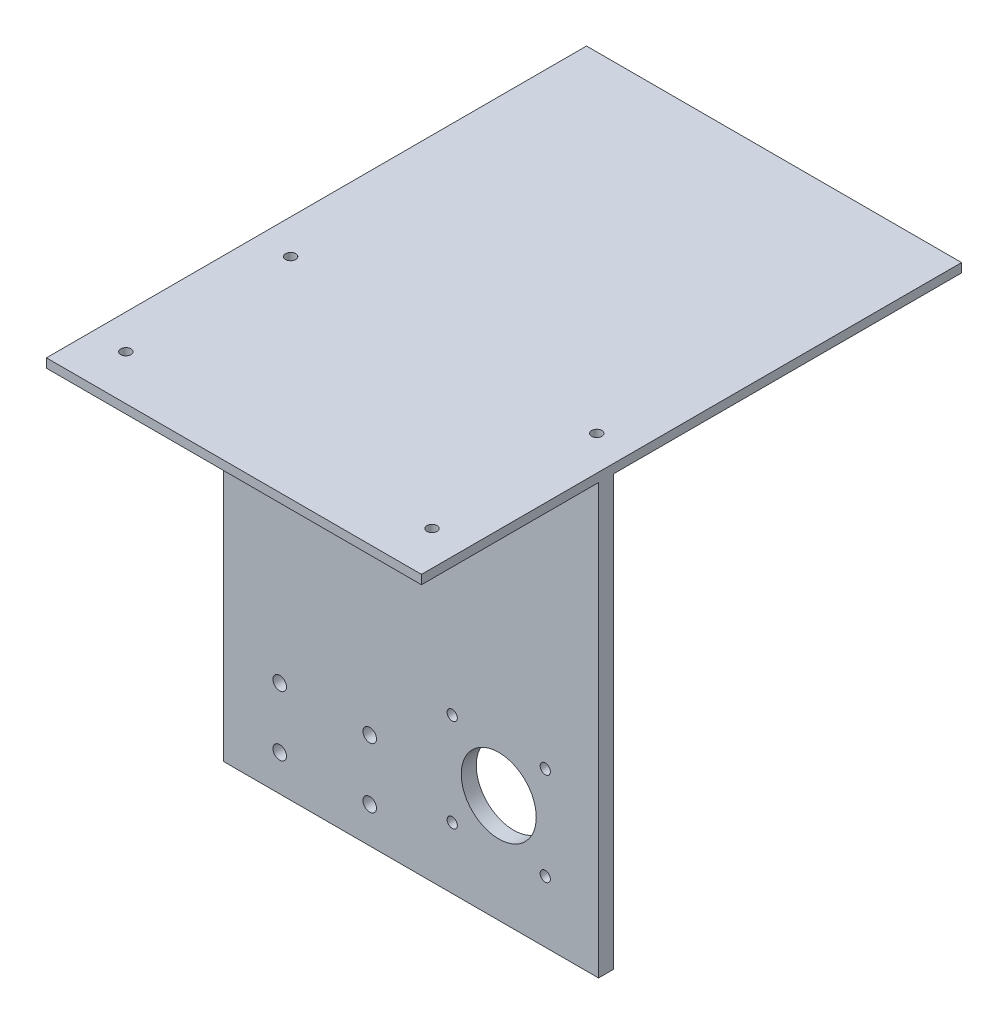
ISO-10303-21;
HEADER;
FILE_DESCRIPTION(('STEP AP214'),'2;1');
FILE_NAME('part.step','',(''),(''),'','','');
FILE_SCHEMA(('AUTOMOTIVE_DESIGN { 1 0 10303 214 1 1 1 1 }'));
ENDSEC;
DATA;
#1=APPLICATION_CONTEXT('core data for automotive mechanical design processes');
#2=APPLICATION_PROTOCOL_DEFINITION('international standard','automotive_design',2000,#1);
#3=PRODUCT_CONTEXT('',#1,'mechanical');
#4=PRODUCT('Part','Part','',(#3));
#5=PRODUCT_RELATED_PRODUCT_CATEGORY('part','',(#4));
#6=PRODUCT_DEFINITION_FORMATION('','',#4);
#7=PRODUCT_DEFINITION_CONTEXT('part definition',#1,'design');
#8=PRODUCT_DEFINITION('design','',#6,#7);
#9=PRODUCT_DEFINITION_SHAPE('','',#8);
#10=(LENGTH_UNIT() NAMED_UNIT(*) SI_UNIT(.MILLI.,.METRE.));
#11=(NAMED_UNIT(*) PLANE_ANGLE_UNIT() SI_UNIT($,.RADIAN.));
#12=(NAMED_UNIT(*) SI_UNIT($,.STERADIAN.) SOLID_ANGLE_UNIT());
#13=UNCERTAINTY_MEASURE_WITH_UNIT(LENGTH_MEASURE(1.E-05),#10,'distance_accuracy_value','');
#14=(GEOMETRIC_REPRESENTATION_CONTEXT(3) GLOBAL_UNCERTAINTY_ASSIGNED_CONTEXT((#13)) GLOBAL_UNIT_ASSIGNED_CONTEXT((#10,
#11,#12)) REPRESENTATION_CONTEXT('',''));
#15=CARTESIAN_POINT('',(0.,0.,0.));
#16=DIRECTION('',(0.,0.,1.));
#17=DIRECTION('',(1.,0.,0.));
#18=AXIS2_PLACEMENT_3D('',#15,#16,#17);
#19=CARTESIAN_POINT('',(62.5,70.,5.));
#20=DIRECTION('',(-1.,0.,0.));
#21=DIRECTION('',(0.,-1.,0.));
#22=AXIS2_PLACEMENT_3D('',#19,#20,#21);
#23=PLANE('',#22);
#24=DIRECTION('',(0.,1.,0.));
#25=VECTOR('',#24,1.);
#26=CARTESIAN_POINT('',(62.5,70.,0.));
#27=LINE('',#26,#25);
#28=CARTESIAN_POINT('',(62.5,-70.,0.));
#29=VERTEX_POINT('',#28);
#30=CARTESIAN_POINT('',(62.5,73.,0.));
#31=VERTEX_POINT('',#30);
#32=EDGE_CURVE('E74',#29,#31,#27,.T.);
#33=ORIENTED_EDGE('',*,*,#32,.T.);
#34=DIRECTION('',(0.,0.,-1.));
#35=VECTOR('',#34,1.);
#36=CARTESIAN_POINT('',(62.5,73.,-116.));
#37=LINE('',#36,#35);
#38=CARTESIAN_POINT('',(62.5,73.,-116.));
#39=VERTEX_POINT('',#38);
#40=EDGE_CURVE('E280',#31,#39,#37,.T.);
#41=ORIENTED_EDGE('',*,*,#40,.T.);
#42=DIRECTION('',(0.,-1.,0.));
#43=VECTOR('',#42,1.);
#44=CARTESIAN_POINT('',(62.5,76.,-116.));
#45=LINE('',#44,#43);
#46=CARTESIAN_POINT('',(62.5,76.,-116.));
#47=VERTEX_POINT('',#46);
#48=EDGE_CURVE('E143',#47,#39,#45,.T.);
#49=ORIENTED_EDGE('',*,*,#48,.F.);
#50=DIRECTION('',(0.,0.,-1.));
#51=VECTOR('',#50,1.);
#52=CARTESIAN_POINT('',(62.5,76.,-116.));
#53=LINE('',#52,#51);
#54=CARTESIAN_POINT('',(62.5,76.,64.));
#55=VERTEX_POINT('',#54);
#56=EDGE_CURVE('E118',#55,#47,#53,.T.);
#57=ORIENTED_EDGE('',*,*,#56,.F.);
#58=DIRECTION('',(0.,-1.,0.));
#59=VECTOR('',#58,1.);
#60=CARTESIAN_POINT('',(62.5,76.,64.));
#61=LINE('',#60,#59);
#62=CARTESIAN_POINT('',(62.5,73.,64.));
#63=VERTEX_POINT('',#62);
#64=EDGE_CURVE('E114',#55,#63,#61,.T.);
#65=ORIENTED_EDGE('',*,*,#64,.T.);
#66=CARTESIAN_POINT('',(62.5,73.,5.));
#67=VERTEX_POINT('',#66);
#68=EDGE_CURVE('E285',#63,#67,#37,.T.);
#69=ORIENTED_EDGE('',*,*,#68,.T.);
#70=DIRECTION('',(0.,1.,0.));
#71=VECTOR('',#70,1.);
#72=CARTESIAN_POINT('',(62.5,70.,5.));
#73=LINE('',#72,#71);
#74=CARTESIAN_POINT('',(62.5,-70.,5.));
#75=VERTEX_POINT('',#74);
#76=EDGE_CURVE('E254',#75,#67,#73,.T.);
#77=ORIENTED_EDGE('',*,*,#76,.F.);
#78=DIRECTION('',(0.,0.,-1.));
#79=VECTOR('',#78,1.);
#80=CARTESIAN_POINT('',(62.5,-70.,5.));
#81=LINE('',#80,#79);
#82=EDGE_CURVE('E47',#75,#29,#81,.T.);
#83=ORIENTED_EDGE('',*,*,#82,.T.);
#84=EDGE_LOOP('',(#33,#41,#49,#57,#65,#69,#77,#83));
#85=FACE_BOUND('',#84,.T.);
#86=ADVANCED_FACE('F38',(#85),#23,.F.);
#87=CARTESIAN_POINT('',(-62.5,70.,5.));
#88=DIRECTION('',(1.,0.,0.));
#89=DIRECTION('',(0.,1.,0.));
#90=AXIS2_PLACEMENT_3D('',#87,#88,#89);
#91=PLANE('',#90);
#92=DIRECTION('',(0.,-1.,0.));
#93=VECTOR('',#92,1.);
#94=CARTESIAN_POINT('',(-62.5,70.,0.));
#95=LINE('',#94,#93);
#96=CARTESIAN_POINT('',(-62.5,73.,0.));
#97=VERTEX_POINT('',#96);
#98=CARTESIAN_POINT('',(-62.5,-70.,0.));
#99=VERTEX_POINT('',#98);
#100=EDGE_CURVE('E66',#97,#99,#95,.T.);
#101=ORIENTED_EDGE('',*,*,#100,.T.);
#102=DIRECTION('',(0.,0.,-1.));
#103=VECTOR('',#102,1.);
#104=CARTESIAN_POINT('',(-62.5,-70.,5.));
#105=LINE('',#104,#103);
#106=CARTESIAN_POINT('',(-62.5,-70.,5.));
#107=VERTEX_POINT('',#106);
#108=EDGE_CURVE('E11',#107,#99,#105,.T.);
#109=ORIENTED_EDGE('',*,*,#108,.F.);
#110=DIRECTION('',(0.,-1.,0.));
#111=VECTOR('',#110,1.);
#112=CARTESIAN_POINT('',(-62.5,70.,5.));
#113=LINE('',#112,#111);
#114=CARTESIAN_POINT('',(-62.5,73.,5.));
#115=VERTEX_POINT('',#114);
#116=EDGE_CURVE('E257',#115,#107,#113,.T.);
#117=ORIENTED_EDGE('',*,*,#116,.F.);
#118=DIRECTION('',(0.,0.,1.));
#119=VECTOR('',#118,1.);
#120=CARTESIAN_POINT('',(-62.5,73.,-116.));
#121=LINE('',#120,#119);
#122=CARTESIAN_POINT('',(-62.5,73.,64.));
#123=VERTEX_POINT('',#122);
#124=EDGE_CURVE('E132',#115,#123,#121,.T.);
#125=ORIENTED_EDGE('',*,*,#124,.T.);
#126=DIRECTION('',(0.,-1.,0.));
#127=VECTOR('',#126,1.);
#128=CARTESIAN_POINT('',(-62.5,76.,64.));
#129=LINE('',#128,#127);
#130=CARTESIAN_POINT('',(-62.5,76.,64.));
#131=VERTEX_POINT('',#130);
#132=EDGE_CURVE('E112',#131,#123,#129,.T.);
#133=ORIENTED_EDGE('',*,*,#132,.F.);
#134=DIRECTION('',(0.,0.,1.));
#135=VECTOR('',#134,1.);
#136=CARTESIAN_POINT('',(-62.5,76.,-116.));
#137=LINE('',#136,#135);
#138=CARTESIAN_POINT('',(-62.5,76.,-116.));
#139=VERTEX_POINT('',#138);
#140=EDGE_CURVE('E119',#139,#131,#137,.T.);
#141=ORIENTED_EDGE('',*,*,#140,.F.);
#142=DIRECTION('',(0.,-1.,0.));
#143=VECTOR('',#142,1.);
#144=CARTESIAN_POINT('',(-62.5,76.,-116.));
#145=LINE('',#144,#143);
#146=CARTESIAN_POINT('',(-62.5,73.,-116.));
#147=VERTEX_POINT('',#146);
#148=EDGE_CURVE('E297',#139,#147,#145,.T.);
#149=ORIENTED_EDGE('',*,*,#148,.T.);
#150=EDGE_CURVE('E291',#147,#97,#121,.T.);
#151=ORIENTED_EDGE('',*,*,#150,.T.);
#152=EDGE_LOOP('',(#101,#109,#117,#125,#133,#141,#149,#151));
#153=FACE_BOUND('',#152,.T.);
#154=ADVANCED_FACE('F130',(#153),#91,.F.);
#155=CARTESIAN_POINT('',(-62.5,-70.,5.));
#156=DIRECTION('',(0.,1.,0.));
#157=DIRECTION('',(0.,0.,1.));
#158=AXIS2_PLACEMENT_3D('',#155,#156,#157);
#159=PLANE('',#158);
#160=DIRECTION('',(1.,0.,0.));
#161=VECTOR('',#160,1.);
#162=CARTESIAN_POINT('',(-62.5,-70.,0.));
#163=LINE('',#162,#161);
#164=EDGE_CURVE('E258',#99,#29,#163,.T.);
#165=ORIENTED_EDGE('',*,*,#164,.T.);
#166=ORIENTED_EDGE('',*,*,#82,.F.);
#167=DIRECTION('',(1.,0.,0.));
#168=VECTOR('',#167,1.);
#169=CARTESIAN_POINT('',(-62.5,-70.,5.));
#170=LINE('',#169,#168);
#171=EDGE_CURVE('E55',#107,#75,#170,.T.);
#172=ORIENTED_EDGE('',*,*,#171,.F.);
#173=ORIENTED_EDGE('',*,*,#108,.T.);
#174=EDGE_LOOP('',(#165,#166,#172,#173));
#175=FACE_BOUND('',#174,.T.);
#176=ADVANCED_FACE('F378',(#175),#159,.F.);
#177=CARTESIAN_POINT('',(0.,0.,5.));
#178=DIRECTION('',(0.,0.,1.));
#179=DIRECTION('',(1.,0.,0.));
#180=AXIS2_PLACEMENT_3D('',#177,#178,#179);
#181=PLANE('',#180);
#182=CARTESIAN_POINT('',(29.25,-34.,5.));
#183=DIRECTION('',(0.,0.,1.));
#184=DIRECTION('',(1.,0.,0.));
#185=AXIS2_PLACEMENT_3D('',#182,#183,#184);
#186=CIRCLE('',#185,12.5);
#187=CARTESIAN_POINT('',(41.75,-34.,5.));
#188=VERTEX_POINT('',#187);
#189=EDGE_CURVE('E150',#188,#188,#186,.T.);
#190=ORIENTED_EDGE('',*,*,#189,.F.);
#191=EDGE_LOOP('',(#190));
#192=FACE_BOUND('',#191,.T.);
#193=CARTESIAN_POINT('',(-12.75,41.,5.));
#194=DIRECTION('',(0.,0.,1.));
#195=DIRECTION('',(1.,0.,0.));
#196=AXIS2_PLACEMENT_3D('',#193,#194,#195);
#197=CIRCLE('',#196,11.);
#198=CARTESIAN_POINT('',(-1.75,41.,5.));
#199=VERTEX_POINT('',#198);
#200=EDGE_CURVE('E155',#199,#199,#197,.T.);
#201=ORIENTED_EDGE('',*,*,#200,.F.);
#202=EDGE_LOOP('',(#201));
#203=FACE_BOUND('',#202,.T.);
#204=CARTESIAN_POINT('',(13.75,-18.5,5.));
#205=DIRECTION('',(0.,0.,1.));
#206=DIRECTION('',(1.,0.,0.));
#207=AXIS2_PLACEMENT_3D('',#204,#205,#206);
#208=CIRCLE('',#207,1.7);
#209=CARTESIAN_POINT('',(15.45,-18.5,5.));
#210=VERTEX_POINT('',#209);
#211=EDGE_CURVE('E163',#210,#210,#208,.T.);
#212=ORIENTED_EDGE('',*,*,#211,.F.);
#213=EDGE_LOOP('',(#212));
#214=FACE_BOUND('',#213,.T.);
#215=CARTESIAN_POINT('',(44.75,-18.5,5.));
#216=DIRECTION('',(0.,0.,1.));
#217=DIRECTION('',(1.,0.,0.));
#218=AXIS2_PLACEMENT_3D('',#215,#216,#217);
#219=CIRCLE('',#218,1.7);
#220=CARTESIAN_POINT('',(46.45,-18.5,5.));
#221=VERTEX_POINT('',#220);
#222=EDGE_CURVE('E174',#221,#221,#219,.T.);
#223=ORIENTED_EDGE('',*,*,#222,.F.);
#224=EDGE_LOOP('',(#223));
#225=FACE_BOUND('',#224,.T.);
#226=CARTESIAN_POINT('',(13.75,-49.5,5.));
#227=DIRECTION('',(0.,0.,1.));
#228=DIRECTION('',(1.,0.,0.));
#229=AXIS2_PLACEMENT_3D('',#226,#227,#228);
#230=CIRCLE('',#229,1.7);
#231=CARTESIAN_POINT('',(15.45,-49.5,5.));
#232=VERTEX_POINT('',#231);
#233=EDGE_CURVE('E182',#232,#232,#230,.T.);
#234=ORIENTED_EDGE('',*,*,#233,.F.);
#235=EDGE_LOOP('',(#234));
#236=FACE_BOUND('',#235,.T.);
#237=CARTESIAN_POINT('',(44.75,-49.5,5.));
#238=DIRECTION('',(0.,0.,1.));
#239=DIRECTION('',(1.,0.,0.));
#240=AXIS2_PLACEMENT_3D('',#237,#238,#239);
#241=CIRCLE('',#240,1.7);
#242=CARTESIAN_POINT('',(46.45,-49.5,5.));
#243=VERTEX_POINT('',#242);
#244=EDGE_CURVE('E190',#243,#243,#241,.T.);
#245=ORIENTED_EDGE('',*,*,#244,.F.);
#246=EDGE_LOOP('',(#245));
#247=FACE_BOUND('',#246,.T.);
#248=CARTESIAN_POINT('',(-20.25,53.9903810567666,5.));
#249=DIRECTION('',(0.,0.,1.));
#250=DIRECTION('',(1.,0.,0.));
#251=AXIS2_PLACEMENT_3D('',#248,#249,#250);
#252=CIRCLE('',#251,1.7);
#253=CARTESIAN_POINT('',(-18.55,53.9903810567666,5.));
#254=VERTEX_POINT('',#253);
#255=EDGE_CURVE('E198',#254,#254,#252,.T.);
#256=ORIENTED_EDGE('',*,*,#255,.F.);
#257=EDGE_LOOP('',(#256));
#258=FACE_BOUND('',#257,.T.);
#259=CARTESIAN_POINT('',(2.25,41.,5.));
#260=DIRECTION('',(0.,0.,1.));
#261=DIRECTION('',(1.,0.,0.));
#262=AXIS2_PLACEMENT_3D('',#259,#260,#261);
#263=CIRCLE('',#262,1.7);
#264=CARTESIAN_POINT('',(3.95,41.,5.));
#265=VERTEX_POINT('',#264);
#266=EDGE_CURVE('E206',#265,#265,#263,.T.);
#267=ORIENTED_EDGE('',*,*,#266,.F.);
#268=EDGE_LOOP('',(#267));
#269=FACE_BOUND('',#268,.T.);
#270=CARTESIAN_POINT('',(-20.25,28.0096189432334,5.));
#271=DIRECTION('',(0.,0.,1.));
#272=DIRECTION('',(1.,0.,0.));
#273=AXIS2_PLACEMENT_3D('',#270,#271,#272);
#274=CIRCLE('',#273,1.7);
#275=CARTESIAN_POINT('',(-18.55,28.0096189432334,5.));
#276=VERTEX_POINT('',#275);
#277=EDGE_CURVE('E214',#276,#276,#274,.T.);
#278=ORIENTED_EDGE('',*,*,#277,.F.);
#279=EDGE_LOOP('',(#278));
#280=FACE_BOUND('',#279,.T.);
#281=CARTESIAN_POINT('',(-43.75,-38.,5.));
#282=DIRECTION('',(0.,0.,1.));
#283=DIRECTION('',(1.,0.,0.));
#284=AXIS2_PLACEMENT_3D('',#281,#282,#283);
#285=CIRCLE('',#284,2.25);
#286=CARTESIAN_POINT('',(-41.5,-38.,5.));
#287=VERTEX_POINT('',#286);
#288=EDGE_CURVE('E222',#287,#287,#285,.T.);
#289=ORIENTED_EDGE('',*,*,#288,.F.);
#290=EDGE_LOOP('',(#289));
#291=FACE_BOUND('',#290,.T.);
#292=CARTESIAN_POINT('',(-13.75,-38.,5.));
#293=DIRECTION('',(0.,0.,1.));
#294=DIRECTION('',(1.,0.,0.));
#295=AXIS2_PLACEMENT_3D('',#292,#293,#294);
#296=CIRCLE('',#295,2.25);
#297=CARTESIAN_POINT('',(-11.5,-38.,5.));
#298=VERTEX_POINT('',#297);
#299=EDGE_CURVE('E230',#298,#298,#296,.T.);
#300=ORIENTED_EDGE('',*,*,#299,.F.);
#301=EDGE_LOOP('',(#300));
#302=FACE_BOUND('',#301,.T.);
#303=CARTESIAN_POINT('',(-43.75,-58.,5.));
#304=DIRECTION('',(0.,0.,1.));
#305=DIRECTION('',(1.,0.,0.));
#306=AXIS2_PLACEMENT_3D('',#303,#304,#305);
#307=CIRCLE('',#306,2.25);
#308=CARTESIAN_POINT('',(-41.5,-58.,5.));
#309=VERTEX_POINT('',#308);
#310=EDGE_CURVE('E238',#309,#309,#307,.T.);
#311=ORIENTED_EDGE('',*,*,#310,.F.);
#312=EDGE_LOOP('',(#311));
#313=FACE_BOUND('',#312,.T.);
#314=CARTESIAN_POINT('',(-13.75,-58.,5.));
#315=DIRECTION('',(0.,0.,1.));
#316=DIRECTION('',(1.,0.,0.));
#317=AXIS2_PLACEMENT_3D('',#314,#315,#316);
#318=CIRCLE('',#317,2.25);
#319=CARTESIAN_POINT('',(-11.5,-58.,5.));
#320=VERTEX_POINT('',#319);
#321=EDGE_CURVE('E246',#320,#320,#318,.T.);
#322=ORIENTED_EDGE('',*,*,#321,.F.);
#323=EDGE_LOOP('',(#322));
#324=FACE_BOUND('',#323,.T.);
#325=ORIENTED_EDGE('',*,*,#76,.T.);
#326=DIRECTION('',(1.,0.,0.));
#327=VECTOR('',#326,1.);
#328=CARTESIAN_POINT('',(-62.5,73.,5.));
#329=LINE('',#328,#327);
#330=EDGE_CURVE('E135',#115,#67,#329,.T.);
#331=ORIENTED_EDGE('',*,*,#330,.F.);
#332=ORIENTED_EDGE('',*,*,#116,.T.);
#333=ORIENTED_EDGE('',*,*,#171,.T.);
#334=EDGE_LOOP('',(#325,#331,#332,#333));
#335=FACE_BOUND('',#334,.T.);
#336=ADVANCED_FACE('F382',(#192,#203,#214,#225,#236,#247,#258,#269,#280,#291,#302,#313,#324,
#335),#181,.T.);
#337=CARTESIAN_POINT('',(0.,0.,0.));
#338=DIRECTION('',(0.,0.,1.));
#339=DIRECTION('',(1.,0.,0.));
#340=AXIS2_PLACEMENT_3D('',#337,#338,#339);
#341=PLANE('',#340);
#342=CARTESIAN_POINT('',(29.25,-34.,0.));
#343=DIRECTION('',(0.,0.,1.));
#344=DIRECTION('',(1.,0.,0.));
#345=AXIS2_PLACEMENT_3D('',#342,#343,#344);
#346=CIRCLE('',#345,12.5);
#347=CARTESIAN_POINT('',(41.75,-34.,0.));
#348=VERTEX_POINT('',#347);
#349=EDGE_CURVE('E151',#348,#348,#346,.T.);
#350=ORIENTED_EDGE('',*,*,#349,.T.);
#351=EDGE_LOOP('',(#350));
#352=FACE_BOUND('',#351,.T.);
#353=CARTESIAN_POINT('',(-12.75,41.,0.));
#354=DIRECTION('',(0.,0.,1.));
#355=DIRECTION('',(1.,0.,0.));
#356=AXIS2_PLACEMENT_3D('',#353,#354,#355);
#357=CIRCLE('',#356,11.);
#358=CARTESIAN_POINT('',(-1.75,41.,0.));
#359=VERTEX_POINT('',#358);
#360=EDGE_CURVE('E159',#359,#359,#357,.T.);
#361=ORIENTED_EDGE('',*,*,#360,.T.);
#362=EDGE_LOOP('',(#361));
#363=FACE_BOUND('',#362,.T.);
#364=CARTESIAN_POINT('',(13.75,-18.5,0.));
#365=DIRECTION('',(0.,0.,1.));
#366=DIRECTION('',(1.,0.,0.));
#367=AXIS2_PLACEMENT_3D('',#364,#365,#366);
#368=CIRCLE('',#367,1.7);
#369=CARTESIAN_POINT('',(15.45,-18.5,0.));
#370=VERTEX_POINT('',#369);
#371=EDGE_CURVE('E170',#370,#370,#368,.T.);
#372=ORIENTED_EDGE('',*,*,#371,.T.);
#373=EDGE_LOOP('',(#372));
#374=FACE_BOUND('',#373,.T.);
#375=CARTESIAN_POINT('',(44.75,-18.5,0.));
#376=DIRECTION('',(0.,0.,1.));
#377=DIRECTION('',(1.,0.,0.));
#378=AXIS2_PLACEMENT_3D('',#375,#376,#377);
#379=CIRCLE('',#378,1.7);
#380=CARTESIAN_POINT('',(46.45,-18.5,0.));
#381=VERTEX_POINT('',#380);
#382=EDGE_CURVE('E178',#381,#381,#379,.T.);
#383=ORIENTED_EDGE('',*,*,#382,.T.);
#384=EDGE_LOOP('',(#383));
#385=FACE_BOUND('',#384,.T.);
#386=CARTESIAN_POINT('',(13.75,-49.5,0.));
#387=DIRECTION('',(0.,0.,1.));
#388=DIRECTION('',(1.,0.,0.));
#389=AXIS2_PLACEMENT_3D('',#386,#387,#388);
#390=CIRCLE('',#389,1.7);
#391=CARTESIAN_POINT('',(15.45,-49.5,0.));
#392=VERTEX_POINT('',#391);
#393=EDGE_CURVE('E186',#392,#392,#390,.T.);
#394=ORIENTED_EDGE('',*,*,#393,.T.);
#395=EDGE_LOOP('',(#394));
#396=FACE_BOUND('',#395,.T.);
#397=CARTESIAN_POINT('',(44.75,-49.5,0.));
#398=DIRECTION('',(0.,0.,1.));
#399=DIRECTION('',(1.,0.,0.));
#400=AXIS2_PLACEMENT_3D('',#397,#398,#399);
#401=CIRCLE('',#400,1.7);
#402=CARTESIAN_POINT('',(46.45,-49.5,0.));
#403=VERTEX_POINT('',#402);
#404=EDGE_CURVE('E194',#403,#403,#401,.T.);
#405=ORIENTED_EDGE('',*,*,#404,.T.);
#406=EDGE_LOOP('',(#405));
#407=FACE_BOUND('',#406,.T.);
#408=CARTESIAN_POINT('',(-20.25,53.9903810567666,0.));
#409=DIRECTION('',(0.,0.,1.));
#410=DIRECTION('',(1.,0.,0.));
#411=AXIS2_PLACEMENT_3D('',#408,#409,#410);
#412=CIRCLE('',#411,1.7);
#413=CARTESIAN_POINT('',(-18.55,53.9903810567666,0.));
#414=VERTEX_POINT('',#413);
#415=EDGE_CURVE('E202',#414,#414,#412,.T.);
#416=ORIENTED_EDGE('',*,*,#415,.T.);
#417=EDGE_LOOP('',(#416));
#418=FACE_BOUND('',#417,.T.);
#419=CARTESIAN_POINT('',(2.25,41.,0.));
#420=DIRECTION('',(0.,0.,1.));
#421=DIRECTION('',(1.,0.,0.));
#422=AXIS2_PLACEMENT_3D('',#419,#420,#421);
#423=CIRCLE('',#422,1.7);
#424=CARTESIAN_POINT('',(3.95,41.,0.));
#425=VERTEX_POINT('',#424);
#426=EDGE_CURVE('E210',#425,#425,#423,.T.);
#427=ORIENTED_EDGE('',*,*,#426,.T.);
#428=EDGE_LOOP('',(#427));
#429=FACE_BOUND('',#428,.T.);
#430=CARTESIAN_POINT('',(-20.25,28.0096189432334,0.));
#431=DIRECTION('',(0.,0.,1.));
#432=DIRECTION('',(1.,0.,0.));
#433=AXIS2_PLACEMENT_3D('',#430,#431,#432);
#434=CIRCLE('',#433,1.7);
#435=CARTESIAN_POINT('',(-18.55,28.0096189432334,0.));
#436=VERTEX_POINT('',#435);
#437=EDGE_CURVE('E218',#436,#436,#434,.T.);
#438=ORIENTED_EDGE('',*,*,#437,.T.);
#439=EDGE_LOOP('',(#438));
#440=FACE_BOUND('',#439,.T.);
#441=CARTESIAN_POINT('',(-43.75,-38.,0.));
#442=DIRECTION('',(0.,0.,1.));
#443=DIRECTION('',(1.,0.,0.));
#444=AXIS2_PLACEMENT_3D('',#441,#442,#443);
#445=CIRCLE('',#444,2.25);
#446=CARTESIAN_POINT('',(-41.5,-38.,0.));
#447=VERTEX_POINT('',#446);
#448=EDGE_CURVE('E226',#447,#447,#445,.T.);
#449=ORIENTED_EDGE('',*,*,#448,.T.);
#450=EDGE_LOOP('',(#449));
#451=FACE_BOUND('',#450,.T.);
#452=CARTESIAN_POINT('',(-13.75,-38.,0.));
#453=DIRECTION('',(0.,0.,1.));
#454=DIRECTION('',(1.,0.,0.));
#455=AXIS2_PLACEMENT_3D('',#452,#453,#454);
#456=CIRCLE('',#455,2.25);
#457=CARTESIAN_POINT('',(-11.5,-38.,0.));
#458=VERTEX_POINT('',#457);
#459=EDGE_CURVE('E234',#458,#458,#456,.T.);
#460=ORIENTED_EDGE('',*,*,#459,.T.);
#461=EDGE_LOOP('',(#460));
#462=FACE_BOUND('',#461,.T.);
#463=CARTESIAN_POINT('',(-43.75,-58.,0.));
#464=DIRECTION('',(0.,0.,1.));
#465=DIRECTION('',(1.,0.,0.));
#466=AXIS2_PLACEMENT_3D('',#463,#464,#465);
#467=CIRCLE('',#466,2.25);
#468=CARTESIAN_POINT('',(-41.5,-58.,0.));
#469=VERTEX_POINT('',#468);
#470=EDGE_CURVE('E242',#469,#469,#467,.T.);
#471=ORIENTED_EDGE('',*,*,#470,.T.);
#472=EDGE_LOOP('',(#471));
#473=FACE_BOUND('',#472,.T.);
#474=CARTESIAN_POINT('',(-13.75,-58.,0.));
#475=DIRECTION('',(0.,0.,1.));
#476=DIRECTION('',(1.,0.,0.));
#477=AXIS2_PLACEMENT_3D('',#474,#475,#476);
#478=CIRCLE('',#477,2.25);
#479=CARTESIAN_POINT('',(-11.5,-58.,0.));
#480=VERTEX_POINT('',#479);
#481=EDGE_CURVE('E250',#480,#480,#478,.T.);
#482=ORIENTED_EDGE('',*,*,#481,.T.);
#483=EDGE_LOOP('',(#482));
#484=FACE_BOUND('',#483,.T.);
#485=ORIENTED_EDGE('',*,*,#32,.F.);
#486=ORIENTED_EDGE('',*,*,#164,.F.);
#487=ORIENTED_EDGE('',*,*,#100,.F.);
#488=DIRECTION('',(-1.,0.,0.));
#489=VECTOR('',#488,1.);
#490=CARTESIAN_POINT('',(-62.5,73.,0.));
#491=LINE('',#490,#489);
#492=EDGE_CURVE('E141',#31,#97,#491,.T.);
#493=ORIENTED_EDGE('',*,*,#492,.F.);
#494=EDGE_LOOP('',(#485,#486,#487,#493));
#495=FACE_BOUND('',#494,.T.);
#496=ADVANCED_FACE('F275',(#352,#363,#374,#385,#396,#407,#418,#429,#440,#451,#462,#473,#484,
#495),#341,.F.);
#497=CARTESIAN_POINT('',(-13.75,-58.,5.));
#498=DIRECTION('',(0.,0.,1.));
#499=DIRECTION('',(1.,0.,0.));
#500=AXIS2_PLACEMENT_3D('',#497,#498,#499);
#501=CYLINDRICAL_SURFACE('',#500,2.25);
#502=ORIENTED_EDGE('',*,*,#481,.F.);
#503=EDGE_LOOP('',(#502));
#504=FACE_BOUND('',#503,.T.);
#505=ORIENTED_EDGE('',*,*,#321,.T.);
#506=EDGE_LOOP('',(#505));
#507=FACE_BOUND('',#506,.T.);
#508=ADVANCED_FACE('F387',(#504,#507),#501,.F.);
#509=CARTESIAN_POINT('',(-43.75,-58.,5.));
#510=DIRECTION('',(0.,0.,1.));
#511=DIRECTION('',(1.,0.,0.));
#512=AXIS2_PLACEMENT_3D('',#509,#510,#511);
#513=CYLINDRICAL_SURFACE('',#512,2.25);
#514=ORIENTED_EDGE('',*,*,#470,.F.);
#515=EDGE_LOOP('',(#514));
#516=FACE_BOUND('',#515,.T.);
#517=ORIENTED_EDGE('',*,*,#310,.T.);
#518=EDGE_LOOP('',(#517));
#519=FACE_BOUND('',#518,.T.);
#520=ADVANCED_FACE('F393',(#516,#519),#513,.F.);
#521=CARTESIAN_POINT('',(-13.75,-38.,5.));
#522=DIRECTION('',(0.,0.,1.));
#523=DIRECTION('',(1.,0.,0.));
#524=AXIS2_PLACEMENT_3D('',#521,#522,#523);
#525=CYLINDRICAL_SURFACE('',#524,2.25);
#526=ORIENTED_EDGE('',*,*,#459,.F.);
#527=EDGE_LOOP('',(#526));
#528=FACE_BOUND('',#527,.T.);
#529=ORIENTED_EDGE('',*,*,#299,.T.);
#530=EDGE_LOOP('',(#529));
#531=FACE_BOUND('',#530,.T.);
#532=ADVANCED_FACE('F397',(#528,#531),#525,.F.);
#533=CARTESIAN_POINT('',(-43.75,-38.,5.));
#534=DIRECTION('',(0.,0.,1.));
#535=DIRECTION('',(1.,0.,0.));
#536=AXIS2_PLACEMENT_3D('',#533,#534,#535);
#537=CYLINDRICAL_SURFACE('',#536,2.25);
#538=ORIENTED_EDGE('',*,*,#448,.F.);
#539=EDGE_LOOP('',(#538));
#540=FACE_BOUND('',#539,.T.);
#541=ORIENTED_EDGE('',*,*,#288,.T.);
#542=EDGE_LOOP('',(#541));
#543=FACE_BOUND('',#542,.T.);
#544=ADVANCED_FACE('F401',(#540,#543),#537,.F.);
#545=CARTESIAN_POINT('',(-20.25,28.0096189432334,5.));
#546=DIRECTION('',(0.,0.,1.));
#547=DIRECTION('',(1.,0.,0.));
#548=AXIS2_PLACEMENT_3D('',#545,#546,#547);
#549=CYLINDRICAL_SURFACE('',#548,1.7);
#550=ORIENTED_EDGE('',*,*,#437,.F.);
#551=EDGE_LOOP('',(#550));
#552=FACE_BOUND('',#551,.T.);
#553=ORIENTED_EDGE('',*,*,#277,.T.);
#554=EDGE_LOOP('',(#553));
#555=FACE_BOUND('',#554,.T.);
#556=ADVANCED_FACE('F405',(#552,#555),#549,.F.);
#557=CARTESIAN_POINT('',(2.25,41.,5.));
#558=DIRECTION('',(0.,0.,1.));
#559=DIRECTION('',(1.,0.,0.));
#560=AXIS2_PLACEMENT_3D('',#557,#558,#559);
#561=CYLINDRICAL_SURFACE('',#560,1.7);
#562=ORIENTED_EDGE('',*,*,#426,.F.);
#563=EDGE_LOOP('',(#562));
#564=FACE_BOUND('',#563,.T.);
#565=ORIENTED_EDGE('',*,*,#266,.T.);
#566=EDGE_LOOP('',(#565));
#567=FACE_BOUND('',#566,.T.);
#568=ADVANCED_FACE('F409',(#564,#567),#561,.F.);
#569=CARTESIAN_POINT('',(-20.25,53.9903810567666,5.));
#570=DIRECTION('',(0.,0.,1.));
#571=DIRECTION('',(1.,0.,0.));
#572=AXIS2_PLACEMENT_3D('',#569,#570,#571);
#573=CYLINDRICAL_SURFACE('',#572,1.7);
#574=ORIENTED_EDGE('',*,*,#415,.F.);
#575=EDGE_LOOP('',(#574));
#576=FACE_BOUND('',#575,.T.);
#577=ORIENTED_EDGE('',*,*,#255,.T.);
#578=EDGE_LOOP('',(#577));
#579=FACE_BOUND('',#578,.T.);
#580=ADVANCED_FACE('F413',(#576,#579),#573,.F.);
#581=CARTESIAN_POINT('',(44.75,-49.5,5.));
#582=DIRECTION('',(0.,0.,1.));
#583=DIRECTION('',(1.,0.,0.));
#584=AXIS2_PLACEMENT_3D('',#581,#582,#583);
#585=CYLINDRICAL_SURFACE('',#584,1.7);
#586=ORIENTED_EDGE('',*,*,#404,.F.);
#587=EDGE_LOOP('',(#586));
#588=FACE_BOUND('',#587,.T.);
#589=ORIENTED_EDGE('',*,*,#244,.T.);
#590=EDGE_LOOP('',(#589));
#591=FACE_BOUND('',#590,.T.);
#592=ADVANCED_FACE('F417',(#588,#591),#585,.F.);
#593=CARTESIAN_POINT('',(13.75,-49.5,5.));
#594=DIRECTION('',(0.,0.,1.));
#595=DIRECTION('',(1.,0.,0.));
#596=AXIS2_PLACEMENT_3D('',#593,#594,#595);
#597=CYLINDRICAL_SURFACE('',#596,1.7);
#598=ORIENTED_EDGE('',*,*,#393,.F.);
#599=EDGE_LOOP('',(#598));
#600=FACE_BOUND('',#599,.T.);
#601=ORIENTED_EDGE('',*,*,#233,.T.);
#602=EDGE_LOOP('',(#601));
#603=FACE_BOUND('',#602,.T.);
#604=ADVANCED_FACE('F421',(#600,#603),#597,.F.);
#605=CARTESIAN_POINT('',(44.75,-18.5,5.));
#606=DIRECTION('',(0.,0.,1.));
#607=DIRECTION('',(1.,0.,0.));
#608=AXIS2_PLACEMENT_3D('',#605,#606,#607);
#609=CYLINDRICAL_SURFACE('',#608,1.7);
#610=ORIENTED_EDGE('',*,*,#382,.F.);
#611=EDGE_LOOP('',(#610));
#612=FACE_BOUND('',#611,.T.);
#613=ORIENTED_EDGE('',*,*,#222,.T.);
#614=EDGE_LOOP('',(#613));
#615=FACE_BOUND('',#614,.T.);
#616=ADVANCED_FACE('F425',(#612,#615),#609,.F.);
#617=CARTESIAN_POINT('',(13.75,-18.5,5.));
#618=DIRECTION('',(0.,0.,1.));
#619=DIRECTION('',(1.,0.,0.));
#620=AXIS2_PLACEMENT_3D('',#617,#618,#619);
#621=CYLINDRICAL_SURFACE('',#620,1.7);
#622=ORIENTED_EDGE('',*,*,#371,.F.);
#623=EDGE_LOOP('',(#622));
#624=FACE_BOUND('',#623,.T.);
#625=ORIENTED_EDGE('',*,*,#211,.T.);
#626=EDGE_LOOP('',(#625));
#627=FACE_BOUND('',#626,.T.);
#628=ADVANCED_FACE('F429',(#624,#627),#621,.F.);
#629=CARTESIAN_POINT('',(-12.75,41.,0.));
#630=DIRECTION('',(0.,0.,1.));
#631=DIRECTION('',(1.,0.,0.));
#632=AXIS2_PLACEMENT_3D('',#629,#630,#631);
#633=CYLINDRICAL_SURFACE('',#632,11.);
#634=ORIENTED_EDGE('',*,*,#360,.F.);
#635=EDGE_LOOP('',(#634));
#636=FACE_BOUND('',#635,.T.);
#637=ORIENTED_EDGE('',*,*,#200,.T.);
#638=EDGE_LOOP('',(#637));
#639=FACE_BOUND('',#638,.T.);
#640=ADVANCED_FACE('F433',(#636,#639),#633,.F.);
#641=CARTESIAN_POINT('',(29.25,-34.,0.));
#642=DIRECTION('',(0.,0.,1.));
#643=DIRECTION('',(1.,0.,0.));
#644=AXIS2_PLACEMENT_3D('',#641,#642,#643);
#645=CYLINDRICAL_SURFACE('',#644,12.5);
#646=ORIENTED_EDGE('',*,*,#349,.F.);
#647=EDGE_LOOP('',(#646));
#648=FACE_BOUND('',#647,.T.);
#649=ORIENTED_EDGE('',*,*,#189,.T.);
#650=EDGE_LOOP('',(#649));
#651=FACE_BOUND('',#650,.T.);
#652=ADVANCED_FACE('F437',(#648,#651),#645,.F.);
#653=CARTESIAN_POINT('',(0.,73.,0.));
#654=DIRECTION('',(0.,1.,0.));
#655=DIRECTION('',(0.,0.,1.));
#656=AXIS2_PLACEMENT_3D('',#653,#654,#655);
#657=PLANE('',#656);
#658=CARTESIAN_POINT('',(-51.02,73.,49.));
#659=DIRECTION('',(0.,1.,0.));
#660=DIRECTION('',(0.,0.,1.));
#661=AXIS2_PLACEMENT_3D('',#658,#659,#660);
#662=CIRCLE('',#661,1.7);
#663=CARTESIAN_POINT('',(-51.02,73.,50.7));
#664=VERTEX_POINT('',#663);
#665=EDGE_CURVE('E341',#664,#664,#662,.T.);
#666=ORIENTED_EDGE('',*,*,#665,.T.);
#667=EDGE_LOOP('',(#666));
#668=FACE_BOUND('',#667,.T.);
#669=CARTESIAN_POINT('',(51.02,73.,49.));
#670=DIRECTION('',(0.,1.,0.));
#671=DIRECTION('',(0.,0.,1.));
#672=AXIS2_PLACEMENT_3D('',#669,#670,#671);
#673=CIRCLE('',#672,1.7);
#674=CARTESIAN_POINT('',(51.02,73.,50.7));
#675=VERTEX_POINT('',#674);
#676=EDGE_CURVE('E312',#675,#675,#673,.T.);
#677=ORIENTED_EDGE('',*,*,#676,.T.);
#678=EDGE_LOOP('',(#677));
#679=FACE_BOUND('',#678,.T.);
#680=ORIENTED_EDGE('',*,*,#124,.F.);
#681=ORIENTED_EDGE('',*,*,#330,.T.);
#682=ORIENTED_EDGE('',*,*,#68,.F.);
#683=DIRECTION('',(1.,0.,0.));
#684=VECTOR('',#683,1.);
#685=CARTESIAN_POINT('',(-62.5,73.,64.));
#686=LINE('',#685,#684);
#687=EDGE_CURVE('E286',#123,#63,#686,.T.);
#688=ORIENTED_EDGE('',*,*,#687,.F.);
#689=EDGE_LOOP('',(#680,#681,#682,#688));
#690=FACE_BOUND('',#689,.T.);
#691=ADVANCED_FACE('F441',(#668,#679,#690),#657,.F.);
#692=CARTESIAN_POINT('',(51.02,73.,-5.9));
#693=DIRECTION('',(0.,1.,0.));
#694=DIRECTION('',(0.,0.,1.));
#695=AXIS2_PLACEMENT_3D('',#692,#693,#694);
#696=CIRCLE('',#695,1.7);
#697=CARTESIAN_POINT('',(51.02,73.,-4.2));
#698=VERTEX_POINT('',#697);
#699=EDGE_CURVE('E333',#698,#698,#696,.T.);
#700=ORIENTED_EDGE('',*,*,#699,.T.);
#701=EDGE_LOOP('',(#700));
#702=FACE_BOUND('',#701,.T.);
#703=CARTESIAN_POINT('',(-51.02,73.,-5.9));
#704=DIRECTION('',(0.,1.,0.));
#705=DIRECTION('',(0.,0.,1.));
#706=AXIS2_PLACEMENT_3D('',#703,#704,#705);
#707=CIRCLE('',#706,1.7);
#708=CARTESIAN_POINT('',(-51.02,73.,-4.2));
#709=VERTEX_POINT('',#708);
#710=EDGE_CURVE('E323',#709,#709,#707,.T.);
#711=ORIENTED_EDGE('',*,*,#710,.T.);
#712=EDGE_LOOP('',(#711));
#713=FACE_BOUND('',#712,.T.);
#714=ORIENTED_EDGE('',*,*,#40,.F.);
#715=ORIENTED_EDGE('',*,*,#492,.T.);
#716=ORIENTED_EDGE('',*,*,#150,.F.);
#717=DIRECTION('',(-1.,0.,0.));
#718=VECTOR('',#717,1.);
#719=CARTESIAN_POINT('',(-62.5,73.,-116.));
#720=LINE('',#719,#718);
#721=EDGE_CURVE('E128',#39,#147,#720,.T.);
#722=ORIENTED_EDGE('',*,*,#721,.F.);
#723=EDGE_LOOP('',(#714,#715,#716,#722));
#724=FACE_BOUND('',#723,.T.);
#725=ADVANCED_FACE('F281',(#702,#713,#724),#657,.F.);
#726=CARTESIAN_POINT('',(-62.5,76.,64.));
#727=DIRECTION('',(0.,0.,-1.));
#728=DIRECTION('',(-1.,0.,0.));
#729=AXIS2_PLACEMENT_3D('',#726,#727,#728);
#730=PLANE('',#729);
#731=ORIENTED_EDGE('',*,*,#687,.T.);
#732=ORIENTED_EDGE('',*,*,#64,.F.);
#733=DIRECTION('',(1.,0.,0.));
#734=VECTOR('',#733,1.);
#735=CARTESIAN_POINT('',(-62.5,76.,64.));
#736=LINE('',#735,#734);
#737=EDGE_CURVE('E108',#131,#55,#736,.T.);
#738=ORIENTED_EDGE('',*,*,#737,.F.);
#739=ORIENTED_EDGE('',*,*,#132,.T.);
#740=EDGE_LOOP('',(#731,#732,#738,#739));
#741=FACE_BOUND('',#740,.T.);
#742=ADVANCED_FACE('F110',(#741),#730,.F.);
#743=CARTESIAN_POINT('',(-62.5,76.,-116.));
#744=DIRECTION('',(0.,0.,1.));
#745=DIRECTION('',(1.,0.,0.));
#746=AXIS2_PLACEMENT_3D('',#743,#744,#745);
#747=PLANE('',#746);
#748=ORIENTED_EDGE('',*,*,#721,.T.);
#749=ORIENTED_EDGE('',*,*,#148,.F.);
#750=DIRECTION('',(-1.,0.,0.));
#751=VECTOR('',#750,1.);
#752=CARTESIAN_POINT('',(-62.5,76.,-116.));
#753=LINE('',#752,#751);
#754=EDGE_CURVE('E124',#47,#139,#753,.T.);
#755=ORIENTED_EDGE('',*,*,#754,.F.);
#756=ORIENTED_EDGE('',*,*,#48,.T.);
#757=EDGE_LOOP('',(#748,#749,#755,#756));
#758=FACE_BOUND('',#757,.T.);
#759=ADVANCED_FACE('F302',(#758),#747,.F.);
#760=CARTESIAN_POINT('',(0.,76.,0.));
#761=DIRECTION('',(0.,1.,0.));
#762=DIRECTION('',(0.,0.,1.));
#763=AXIS2_PLACEMENT_3D('',#760,#761,#762);
#764=PLANE('',#763);
#765=CARTESIAN_POINT('',(-51.02,76.,49.));
#766=DIRECTION('',(0.,1.,0.));
#767=DIRECTION('',(0.,0.,1.));
#768=AXIS2_PLACEMENT_3D('',#765,#766,#767);
#769=CIRCLE('',#768,1.7);
#770=CARTESIAN_POINT('',(-51.02,76.,50.7));
#771=VERTEX_POINT('',#770);
#772=EDGE_CURVE('E345',#771,#771,#769,.T.);
#773=ORIENTED_EDGE('',*,*,#772,.F.);
#774=EDGE_LOOP('',(#773));
#775=FACE_BOUND('',#774,.T.);
#776=CARTESIAN_POINT('',(51.02,76.,-5.9));
#777=DIRECTION('',(0.,1.,0.));
#778=DIRECTION('',(0.,0.,1.));
#779=AXIS2_PLACEMENT_3D('',#776,#777,#778);
#780=CIRCLE('',#779,1.7);
#781=CARTESIAN_POINT('',(51.02,76.,-4.2));
#782=VERTEX_POINT('',#781);
#783=EDGE_CURVE('E337',#782,#782,#780,.T.);
#784=ORIENTED_EDGE('',*,*,#783,.F.);
#785=EDGE_LOOP('',(#784));
#786=FACE_BOUND('',#785,.T.);
#787=CARTESIAN_POINT('',(-51.02,76.,-5.9));
#788=DIRECTION('',(0.,1.,0.));
#789=DIRECTION('',(0.,0.,1.));
#790=AXIS2_PLACEMENT_3D('',#787,#788,#789);
#791=CIRCLE('',#790,1.7);
#792=CARTESIAN_POINT('',(-51.02,76.,-4.2));
#793=VERTEX_POINT('',#792);
#794=EDGE_CURVE('E329',#793,#793,#791,.T.);
#795=ORIENTED_EDGE('',*,*,#794,.F.);
#796=EDGE_LOOP('',(#795));
#797=FACE_BOUND('',#796,.T.);
#798=CARTESIAN_POINT('',(51.02,76.,49.));
#799=DIRECTION('',(0.,1.,0.));
#800=DIRECTION('',(0.,0.,1.));
#801=AXIS2_PLACEMENT_3D('',#798,#799,#800);
#802=CIRCLE('',#801,1.7);
#803=CARTESIAN_POINT('',(51.02,76.,50.7));
#804=VERTEX_POINT('',#803);
#805=EDGE_CURVE('E316',#804,#804,#802,.T.);
#806=ORIENTED_EDGE('',*,*,#805,.F.);
#807=EDGE_LOOP('',(#806));
#808=FACE_BOUND('',#807,.T.);
#809=ORIENTED_EDGE('',*,*,#140,.T.);
#810=ORIENTED_EDGE('',*,*,#737,.T.);
#811=ORIENTED_EDGE('',*,*,#56,.T.);
#812=ORIENTED_EDGE('',*,*,#754,.T.);
#813=EDGE_LOOP('',(#809,#810,#811,#812));
#814=FACE_BOUND('',#813,.T.);
#815=ADVANCED_FACE('F122',(#775,#786,#797,#808,#814),#764,.T.);
#816=CARTESIAN_POINT('',(51.02,76.,49.));
#817=DIRECTION('',(0.,1.,0.));
#818=DIRECTION('',(0.,0.,1.));
#819=AXIS2_PLACEMENT_3D('',#816,#817,#818);
#820=CYLINDRICAL_SURFACE('',#819,1.7);
#821=ORIENTED_EDGE('',*,*,#676,.F.);
#822=EDGE_LOOP('',(#821));
#823=FACE_BOUND('',#822,.T.);
#824=ORIENTED_EDGE('',*,*,#805,.T.);
#825=EDGE_LOOP('',(#824));
#826=FACE_BOUND('',#825,.T.);
#827=ADVANCED_FACE('F355',(#823,#826),#820,.F.);
#828=CARTESIAN_POINT('',(-51.02,76.,-5.9));
#829=DIRECTION('',(0.,1.,0.));
#830=DIRECTION('',(0.,0.,1.));
#831=AXIS2_PLACEMENT_3D('',#828,#829,#830);
#832=CYLINDRICAL_SURFACE('',#831,1.7);
#833=ORIENTED_EDGE('',*,*,#710,.F.);
#834=EDGE_LOOP('',(#833));
#835=FACE_BOUND('',#834,.T.);
#836=ORIENTED_EDGE('',*,*,#794,.T.);
#837=EDGE_LOOP('',(#836));
#838=FACE_BOUND('',#837,.T.);
#839=ADVANCED_FACE('F364',(#835,#838),#832,.F.);
#840=CARTESIAN_POINT('',(51.02,76.,-5.9));
#841=DIRECTION('',(0.,1.,0.));
#842=DIRECTION('',(0.,0.,1.));
#843=AXIS2_PLACEMENT_3D('',#840,#841,#842);
#844=CYLINDRICAL_SURFACE('',#843,1.7);
#845=ORIENTED_EDGE('',*,*,#699,.F.);
#846=EDGE_LOOP('',(#845));
#847=FACE_BOUND('',#846,.T.);
#848=ORIENTED_EDGE('',*,*,#783,.T.);
#849=EDGE_LOOP('',(#848));
#850=FACE_BOUND('',#849,.T.);
#851=ADVANCED_FACE('F370',(#847,#850),#844,.F.);
#852=CARTESIAN_POINT('',(-51.02,76.,49.));
#853=DIRECTION('',(0.,1.,0.));
#854=DIRECTION('',(0.,0.,1.));
#855=AXIS2_PLACEMENT_3D('',#852,#853,#854);
#856=CYLINDRICAL_SURFACE('',#855,1.7);
#857=ORIENTED_EDGE('',*,*,#665,.F.);
#858=EDGE_LOOP('',(#857));
#859=FACE_BOUND('',#858,.T.);
#860=ORIENTED_EDGE('',*,*,#772,.T.);
#861=EDGE_LOOP('',(#860));
#862=FACE_BOUND('',#861,.T.);
#863=ADVANCED_FACE('F351',(#859,#862),#856,.F.);
#864=CLOSED_SHELL('',(#86,#154,#176,#336,#496,#508,#520,#532,#544,#556,#568,#580,#592,#604,#616,
#628,#640,#652,#691,#725,#742,#759,#815,#827,#839,#851,#863));
#865=MANIFOLD_SOLID_BREP('B2',#864);
#866=ADVANCED_BREP_SHAPE_REPRESENTATION('',(#18,#865),#14);
#867=SHAPE_DEFINITION_REPRESENTATION(#9,#866);
ENDSEC;
END-ISO-10303-21;
